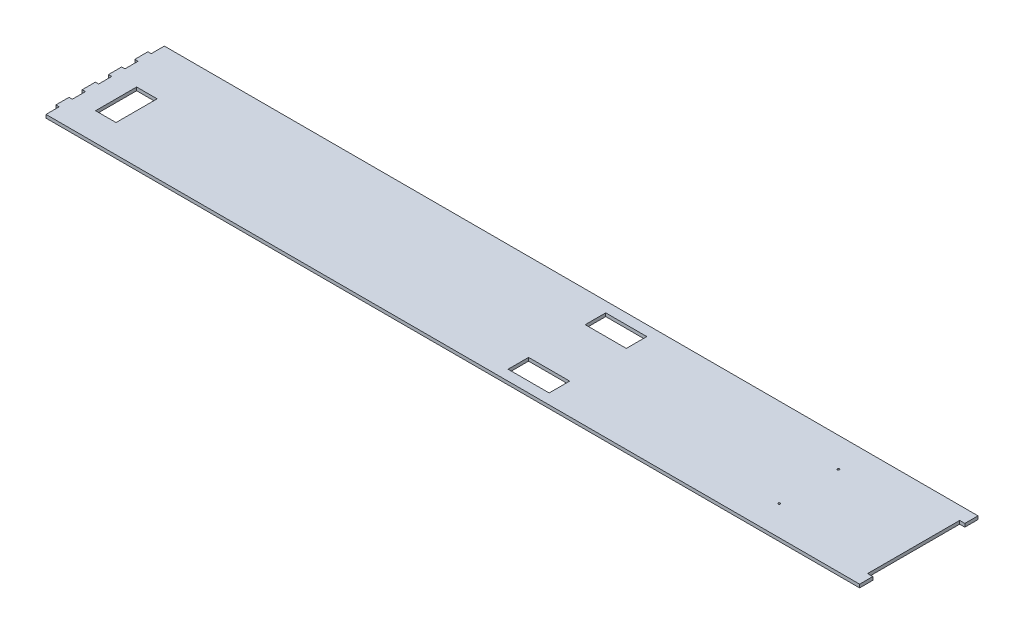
ISO-10303-21;
HEADER;
FILE_DESCRIPTION(('STEP AP214'),'2;1');
FILE_NAME('part.step','',(''),(''),'','','');
FILE_SCHEMA(('AUTOMOTIVE_DESIGN { 1 0 10303 214 1 1 1 1 }'));
ENDSEC;
DATA;
#1=APPLICATION_CONTEXT('core data for automotive mechanical design processes');
#2=APPLICATION_PROTOCOL_DEFINITION('international standard','automotive_design',2000,#1);
#3=PRODUCT_CONTEXT('',#1,'mechanical');
#4=PRODUCT('Part','Part','',(#3));
#5=PRODUCT_RELATED_PRODUCT_CATEGORY('part','',(#4));
#6=PRODUCT_DEFINITION_FORMATION('','',#4);
#7=PRODUCT_DEFINITION_CONTEXT('part definition',#1,'design');
#8=PRODUCT_DEFINITION('design','',#6,#7);
#9=PRODUCT_DEFINITION_SHAPE('','',#8);
#10=(LENGTH_UNIT() NAMED_UNIT(*) SI_UNIT(.MILLI.,.METRE.));
#11=(NAMED_UNIT(*) PLANE_ANGLE_UNIT() SI_UNIT($,.RADIAN.));
#12=(NAMED_UNIT(*) SI_UNIT($,.STERADIAN.) SOLID_ANGLE_UNIT());
#13=UNCERTAINTY_MEASURE_WITH_UNIT(LENGTH_MEASURE(1.E-05),#10,'distance_accuracy_value','');
#14=(GEOMETRIC_REPRESENTATION_CONTEXT(3) GLOBAL_UNCERTAINTY_ASSIGNED_CONTEXT((#13)) GLOBAL_UNIT_ASSIGNED_CONTEXT((#10,
#11,#12)) REPRESENTATION_CONTEXT('',''));
#15=CARTESIAN_POINT('',(0.,0.,0.));
#16=DIRECTION('',(0.,0.,1.));
#17=DIRECTION('',(1.,0.,0.));
#18=AXIS2_PLACEMENT_3D('',#15,#16,#17);
#19=CARTESIAN_POINT('',(0.,3.175,0.));
#20=DIRECTION('',(0.,1.,0.));
#21=DIRECTION('',(0.,0.,1.));
#22=AXIS2_PLACEMENT_3D('',#19,#20,#21);
#23=PLANE('',#22);
#24=DIRECTION('',(1.,0.,0.));
#25=VECTOR('',#24,1.);
#26=CARTESIAN_POINT('',(0.,3.175,47.15));
#27=LINE('',#26,#25);
#28=CARTESIAN_POINT('',(-32.1237299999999,3.175,47.15));
#29=VERTEX_POINT('',#28);
#30=CARTESIAN_POINT('',(7.56377000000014,3.175,47.15));
#31=VERTEX_POINT('',#30);
#32=EDGE_CURVE('E954',#29,#31,#27,.T.);
#33=ORIENTED_EDGE('',*,*,#32,.F.);
#34=DIRECTION('',(0.,0.,-1.));
#35=VECTOR('',#34,1.);
#36=CARTESIAN_POINT('',(-32.1237299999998,3.175,0.));
#37=LINE('',#36,#35);
#38=CARTESIAN_POINT('',(-32.1237299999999,3.175,27.3380000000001));
#39=VERTEX_POINT('',#38);
#40=EDGE_CURVE('E961',#29,#39,#37,.T.);
#41=ORIENTED_EDGE('',*,*,#40,.T.);
#42=DIRECTION('',(1.,0.,0.));
#43=VECTOR('',#42,1.);
#44=CARTESIAN_POINT('',(0.,3.175,27.3380000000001));
#45=LINE('',#44,#43);
#46=CARTESIAN_POINT('',(7.56377000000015,3.175,27.3380000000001));
#47=VERTEX_POINT('',#46);
#48=EDGE_CURVE('E958',#39,#47,#45,.T.);
#49=ORIENTED_EDGE('',*,*,#48,.T.);
#50=DIRECTION('',(0.,0.,-1.));
#51=VECTOR('',#50,1.);
#52=CARTESIAN_POINT('',(7.56377000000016,3.175,0.));
#53=LINE('',#52,#51);
#54=EDGE_CURVE('E956',#31,#47,#53,.T.);
#55=ORIENTED_EDGE('',*,*,#54,.F.);
#56=EDGE_LOOP('',(#33,#41,#49,#55));
#57=FACE_BOUND('',#56,.T.);
#58=DIRECTION('',(0.,0.,1.));
#59=VECTOR('',#58,1.);
#60=CARTESIAN_POINT('',(-32.1237299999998,3.175,0.));
#61=LINE('',#60,#59);
#62=CARTESIAN_POINT('',(-32.1237299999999,3.175,-47.15));
#63=VERTEX_POINT('',#62);
#64=CARTESIAN_POINT('',(-32.1237299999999,3.175,-27.338));
#65=VERTEX_POINT('',#64);
#66=EDGE_CURVE('E902',#63,#65,#61,.T.);
#67=ORIENTED_EDGE('',*,*,#66,.F.);
#68=DIRECTION('',(1.,0.,0.));
#69=VECTOR('',#68,1.);
#70=CARTESIAN_POINT('',(0.,3.175,-47.15));
#71=LINE('',#70,#69);
#72=CARTESIAN_POINT('',(7.56377000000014,3.175,-47.15));
#73=VERTEX_POINT('',#72);
#74=EDGE_CURVE('E951',#63,#73,#71,.T.);
#75=ORIENTED_EDGE('',*,*,#74,.T.);
#76=DIRECTION('',(0.,0.,1.));
#77=VECTOR('',#76,1.);
#78=CARTESIAN_POINT('',(7.56377000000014,3.175,0.));
#79=LINE('',#78,#77);
#80=CARTESIAN_POINT('',(7.56377000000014,3.175,-27.338));
#81=VERTEX_POINT('',#80);
#82=EDGE_CURVE('E948',#73,#81,#79,.T.);
#83=ORIENTED_EDGE('',*,*,#82,.T.);
#84=DIRECTION('',(1.,0.,0.));
#85=VECTOR('',#84,1.);
#86=CARTESIAN_POINT('',(0.,3.175,-27.338));
#87=LINE('',#86,#85);
#88=EDGE_CURVE('E946',#65,#81,#87,.T.);
#89=ORIENTED_EDGE('',*,*,#88,.F.);
#90=EDGE_LOOP('',(#67,#75,#83,#89));
#91=FACE_BOUND('',#90,.T.);
#92=CARTESIAN_POINT('',(211.101966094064,3.175,28.575));
#93=DIRECTION('',(0.,1.,0.));
#94=DIRECTION('',(0.,0.,1.));
#95=AXIS2_PLACEMENT_3D('',#92,#93,#94);
#96=CIRCLE('',#95,0.999999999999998);
#97=CARTESIAN_POINT('',(211.101966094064,3.175,29.575));
#98=VERTEX_POINT('',#97);
#99=EDGE_CURVE('E1035',#98,#98,#96,.F.);
#100=ORIENTED_EDGE('',*,*,#99,.T.);
#101=EDGE_LOOP('',(#100));
#102=FACE_BOUND('',#101,.T.);
#103=CARTESIAN_POINT('',(211.101966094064,3.175,-28.575));
#104=DIRECTION('',(0.,1.,0.));
#105=DIRECTION('',(0.,0.,1.));
#106=AXIS2_PLACEMENT_3D('',#103,#104,#105);
#107=CIRCLE('',#106,0.999999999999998);
#108=CARTESIAN_POINT('',(211.101966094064,3.175,-27.575));
#109=VERTEX_POINT('',#108);
#110=EDGE_CURVE('E1042',#109,#109,#107,.T.);
#111=ORIENTED_EDGE('',*,*,#110,.F.);
#112=EDGE_LOOP('',(#111));
#113=FACE_BOUND('',#112,.T.);
#114=DIRECTION('',(0.,0.,1.));
#115=VECTOR('',#114,1.);
#116=CARTESIAN_POINT('',(317.36377,3.175,0.));
#117=LINE('',#116,#115);
#118=CARTESIAN_POINT('',(317.36377,3.175,-57.15));
#119=VERTEX_POINT('',#118);
#120=CARTESIAN_POINT('',(317.36377,3.175,-44.45));
#121=VERTEX_POINT('',#120);
#122=EDGE_CURVE('E1017',#119,#121,#117,.T.);
#123=ORIENTED_EDGE('',*,*,#122,.F.);
#124=DIRECTION('',(1.,0.,0.));
#125=VECTOR('',#124,1.);
#126=CARTESIAN_POINT('',(0.,3.175,-57.15));
#127=LINE('',#126,#125);
#128=CARTESIAN_POINT('',(-468.3125,3.175,-57.15));
#129=VERTEX_POINT('',#128);
#130=EDGE_CURVE('E1057',#129,#119,#127,.T.);
#131=ORIENTED_EDGE('',*,*,#130,.F.);
#132=DIRECTION('',(0.,0.,-1.));
#133=VECTOR('',#132,1.);
#134=CARTESIAN_POINT('',(-468.3125,3.175,0.));
#135=LINE('',#134,#133);
#136=CARTESIAN_POINT('',(-468.3125,3.175,-44.45));
#137=VERTEX_POINT('',#136);
#138=EDGE_CURVE('E1054',#137,#129,#135,.T.);
#139=ORIENTED_EDGE('',*,*,#138,.F.);
#140=DIRECTION('',(1.,0.,0.));
#141=VECTOR('',#140,1.);
#142=CARTESIAN_POINT('',(0.,3.175,-44.450000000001));
#143=LINE('',#142,#141);
#144=CARTESIAN_POINT('',(-471.4875,3.175,-44.45));
#145=VERTEX_POINT('',#144);
#146=EDGE_CURVE('E1060',#145,#137,#143,.T.);
#147=ORIENTED_EDGE('',*,*,#146,.F.);
#148=DIRECTION('',(0.,0.,1.));
#149=VECTOR('',#148,1.);
#150=CARTESIAN_POINT('',(-471.4875,3.175,-2.28983498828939E-13));
#151=LINE('',#150,#149);
#152=CARTESIAN_POINT('',(-471.4875,3.175,-31.75));
#153=VERTEX_POINT('',#152);
#154=EDGE_CURVE('E1064',#145,#153,#151,.T.);
#155=ORIENTED_EDGE('',*,*,#154,.T.);
#156=DIRECTION('',(-1.,0.,0.));
#157=VECTOR('',#156,1.);
#158=CARTESIAN_POINT('',(0.,3.175,-31.750000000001));
#159=LINE('',#158,#157);
#160=CARTESIAN_POINT('',(-468.3125,3.175,-31.75));
#161=VERTEX_POINT('',#160);
#162=EDGE_CURVE('E1067',#161,#153,#159,.T.);
#163=ORIENTED_EDGE('',*,*,#162,.F.);
#164=CARTESIAN_POINT('',(-468.3125,3.175,-19.05));
#165=VERTEX_POINT('',#164);
#166=EDGE_CURVE('E1071',#165,#161,#135,.T.);
#167=ORIENTED_EDGE('',*,*,#166,.F.);
#168=DIRECTION('',(-1.,0.,0.));
#169=VECTOR('',#168,1.);
#170=CARTESIAN_POINT('',(0.,3.175,-19.050000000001));
#171=LINE('',#170,#169);
#172=CARTESIAN_POINT('',(-471.4875,3.175,-19.05));
#173=VERTEX_POINT('',#172);
#174=EDGE_CURVE('E1072',#165,#173,#171,.T.);
#175=ORIENTED_EDGE('',*,*,#174,.T.);
#176=DIRECTION('',(0.,0.,1.));
#177=VECTOR('',#176,1.);
#178=CARTESIAN_POINT('',(-471.4875,3.175,-2.28983498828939E-13));
#179=LINE('',#178,#177);
#180=CARTESIAN_POINT('',(-471.4875,3.175,-6.35000000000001));
#181=VERTEX_POINT('',#180);
#182=EDGE_CURVE('E1075',#173,#181,#179,.T.);
#183=ORIENTED_EDGE('',*,*,#182,.T.);
#184=DIRECTION('',(-1.,0.,0.));
#185=VECTOR('',#184,1.);
#186=CARTESIAN_POINT('',(0.,3.175,-6.35000000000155));
#187=LINE('',#186,#185);
#188=CARTESIAN_POINT('',(-468.3125,3.175,-6.35000000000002));
#189=VERTEX_POINT('',#188);
#190=EDGE_CURVE('E1078',#189,#181,#187,.T.);
#191=ORIENTED_EDGE('',*,*,#190,.F.);
#192=CARTESIAN_POINT('',(-468.3125,3.175,6.34999999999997));
#193=VERTEX_POINT('',#192);
#194=EDGE_CURVE('E1082',#193,#189,#135,.T.);
#195=ORIENTED_EDGE('',*,*,#194,.F.);
#196=DIRECTION('',(-1.,0.,0.));
#197=VECTOR('',#196,1.);
#198=CARTESIAN_POINT('',(0.,3.175,6.34999999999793));
#199=LINE('',#198,#197);
#200=CARTESIAN_POINT('',(-471.4875,3.175,6.34999999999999));
#201=VERTEX_POINT('',#200);
#202=EDGE_CURVE('E1083',#193,#201,#199,.T.);
#203=ORIENTED_EDGE('',*,*,#202,.T.);
#204=DIRECTION('',(0.,0.,1.));
#205=VECTOR('',#204,1.);
#206=CARTESIAN_POINT('',(-471.4875,3.175,-2.28983498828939E-13));
#207=LINE('',#206,#205);
#208=CARTESIAN_POINT('',(-471.4875,3.175,19.05));
#209=VERTEX_POINT('',#208);
#210=EDGE_CURVE('E1086',#201,#209,#207,.T.);
#211=ORIENTED_EDGE('',*,*,#210,.T.);
#212=DIRECTION('',(-1.,0.,0.));
#213=VECTOR('',#212,1.);
#214=CARTESIAN_POINT('',(0.,3.175,19.0499999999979));
#215=LINE('',#214,#213);
#216=CARTESIAN_POINT('',(-468.3125,3.175,19.05));
#217=VERTEX_POINT('',#216);
#218=EDGE_CURVE('E1089',#217,#209,#215,.T.);
#219=ORIENTED_EDGE('',*,*,#218,.F.);
#220=CARTESIAN_POINT('',(-468.3125,3.175,31.75));
#221=VERTEX_POINT('',#220);
#222=EDGE_CURVE('E1053',#221,#217,#135,.T.);
#223=ORIENTED_EDGE('',*,*,#222,.F.);
#224=DIRECTION('',(-1.,0.,0.));
#225=VECTOR('',#224,1.);
#226=CARTESIAN_POINT('',(0.,3.175,31.7499999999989));
#227=LINE('',#226,#225);
#228=CARTESIAN_POINT('',(-471.4875,3.175,31.75));
#229=VERTEX_POINT('',#228);
#230=EDGE_CURVE('E1093',#221,#229,#227,.T.);
#231=ORIENTED_EDGE('',*,*,#230,.T.);
#232=DIRECTION('',(0.,0.,1.));
#233=VECTOR('',#232,1.);
#234=CARTESIAN_POINT('',(-471.4875,3.175,-2.28983498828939E-13));
#235=LINE('',#234,#233);
#236=CARTESIAN_POINT('',(-471.4875,3.175,44.45));
#237=VERTEX_POINT('',#236);
#238=EDGE_CURVE('E1096',#229,#237,#235,.T.);
#239=ORIENTED_EDGE('',*,*,#238,.T.);
#240=DIRECTION('',(-1.,0.,0.));
#241=VECTOR('',#240,1.);
#242=CARTESIAN_POINT('',(2.9143354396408E-13,3.175,44.4499999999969));
#243=LINE('',#242,#241);
#244=CARTESIAN_POINT('',(-468.3125,3.175,44.45));
#245=VERTEX_POINT('',#244);
#246=EDGE_CURVE('E1099',#245,#237,#243,.T.);
#247=ORIENTED_EDGE('',*,*,#246,.F.);
#248=CARTESIAN_POINT('',(-468.312499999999,3.175,57.15));
#249=VERTEX_POINT('',#248);
#250=EDGE_CURVE('E1047',#249,#245,#135,.T.);
#251=ORIENTED_EDGE('',*,*,#250,.F.);
#252=DIRECTION('',(1.,0.,0.));
#253=VECTOR('',#252,1.);
#254=CARTESIAN_POINT('',(0.,3.175,57.15));
#255=LINE('',#254,#253);
#256=CARTESIAN_POINT('',(317.36377,3.175,57.15));
#257=VERTEX_POINT('',#256);
#258=EDGE_CURVE('E1051',#249,#257,#255,.T.);
#259=ORIENTED_EDGE('',*,*,#258,.T.);
#260=DIRECTION('',(0.,0.,-1.));
#261=VECTOR('',#260,1.);
#262=CARTESIAN_POINT('',(317.36377,3.175,0.));
#263=LINE('',#262,#261);
#264=CARTESIAN_POINT('',(317.36377,3.175,44.45));
#265=VERTEX_POINT('',#264);
#266=EDGE_CURVE('E994',#257,#265,#263,.T.);
#267=ORIENTED_EDGE('',*,*,#266,.T.);
#268=DIRECTION('',(-1.,0.,0.));
#269=VECTOR('',#268,1.);
#270=CARTESIAN_POINT('',(0.,3.175,44.45));
#271=LINE('',#270,#269);
#272=CARTESIAN_POINT('',(312.36377,3.175,44.45));
#273=VERTEX_POINT('',#272);
#274=EDGE_CURVE('E1020',#265,#273,#271,.T.);
#275=ORIENTED_EDGE('',*,*,#274,.T.);
#276=DIRECTION('',(0.,0.,1.));
#277=VECTOR('',#276,1.);
#278=CARTESIAN_POINT('',(312.36377,3.175,0.));
#279=LINE('',#278,#277);
#280=CARTESIAN_POINT('',(312.36377,3.175,-44.45));
#281=VERTEX_POINT('',#280);
#282=EDGE_CURVE('E1027',#281,#273,#279,.T.);
#283=ORIENTED_EDGE('',*,*,#282,.F.);
#284=DIRECTION('',(-1.,0.,0.));
#285=VECTOR('',#284,1.);
#286=CARTESIAN_POINT('',(0.,3.175,-44.45));
#287=LINE('',#286,#285);
#288=EDGE_CURVE('E1024',#121,#281,#287,.T.);
#289=ORIENTED_EDGE('',*,*,#288,.F.);
#290=EDGE_LOOP('',(#123,#131,#139,#147,#155,#163,#167,#175,#183,#191,#195,#203,#211,#219,#223,
#231,#239,#247,#251,#259,#267,#275,#283,#289));
#291=FACE_BOUND('',#290,.T.);
#292=DIRECTION('',(-1.,0.,0.));
#293=VECTOR('',#292,1.);
#294=CARTESIAN_POINT('',(0.,3.175,30.1624999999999));
#295=LINE('',#294,#293);
#296=CARTESIAN_POINT('',(-427.682733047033,3.175,30.1625));
#297=VERTEX_POINT('',#296);
#298=CARTESIAN_POINT('',(-447.494733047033,3.175,30.1625));
#299=VERTEX_POINT('',#298);
#300=EDGE_CURVE('E964',#297,#299,#295,.T.);
#301=ORIENTED_EDGE('',*,*,#300,.T.);
#302=DIRECTION('',(0.,0.,-1.));
#303=VECTOR('',#302,1.);
#304=CARTESIAN_POINT('',(-447.494733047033,3.175,0.));
#305=LINE('',#304,#303);
#306=CARTESIAN_POINT('',(-447.494733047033,3.175,-9.525));
#307=VERTEX_POINT('',#306);
#308=EDGE_CURVE('E886',#299,#307,#305,.T.);
#309=ORIENTED_EDGE('',*,*,#308,.T.);
#310=DIRECTION('',(-1.,0.,0.));
#311=VECTOR('',#310,1.);
#312=CARTESIAN_POINT('',(0.,3.175,-9.52500000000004));
#313=LINE('',#312,#311);
#314=CARTESIAN_POINT('',(-427.682733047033,3.175,-9.525));
#315=VERTEX_POINT('',#314);
#316=EDGE_CURVE('E968',#315,#307,#313,.T.);
#317=ORIENTED_EDGE('',*,*,#316,.F.);
#318=DIRECTION('',(0.,0.,-1.));
#319=VECTOR('',#318,1.);
#320=CARTESIAN_POINT('',(-427.682733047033,3.175,0.));
#321=LINE('',#320,#319);
#322=EDGE_CURVE('E966',#297,#315,#321,.T.);
#323=ORIENTED_EDGE('',*,*,#322,.F.);
#324=EDGE_LOOP('',(#301,#309,#317,#323));
#325=FACE_BOUND('',#324,.T.);
#326=ADVANCED_FACE('F639',(#57,#91,#102,#113,#291,#325),#23,.T.);
#327=CARTESIAN_POINT('',(0.,0.,0.));
#328=DIRECTION('',(0.,1.,0.));
#329=DIRECTION('',(0.,0.,1.));
#330=AXIS2_PLACEMENT_3D('',#327,#328,#329);
#331=PLANE('',#330);
#332=DIRECTION('',(0.,0.,-1.));
#333=VECTOR('',#332,1.);
#334=CARTESIAN_POINT('',(-32.1237299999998,0.,0.));
#335=LINE('',#334,#333);
#336=CARTESIAN_POINT('',(-32.1237299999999,0.,47.15));
#337=VERTEX_POINT('',#336);
#338=CARTESIAN_POINT('',(-32.1237299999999,0.,27.3380000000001));
#339=VERTEX_POINT('',#338);
#340=EDGE_CURVE('E893',#337,#339,#335,.T.);
#341=ORIENTED_EDGE('',*,*,#340,.F.);
#342=DIRECTION('',(1.,0.,0.));
#343=VECTOR('',#342,1.);
#344=CARTESIAN_POINT('',(0.,0.,47.15));
#345=LINE('',#344,#343);
#346=CARTESIAN_POINT('',(7.56377000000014,0.,47.15));
#347=VERTEX_POINT('',#346);
#348=EDGE_CURVE('E895',#337,#347,#345,.T.);
#349=ORIENTED_EDGE('',*,*,#348,.T.);
#350=DIRECTION('',(0.,0.,-1.));
#351=VECTOR('',#350,1.);
#352=CARTESIAN_POINT('',(7.56377000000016,0.,0.));
#353=LINE('',#352,#351);
#354=CARTESIAN_POINT('',(7.56377000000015,0.,27.3380000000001));
#355=VERTEX_POINT('',#354);
#356=EDGE_CURVE('E920',#347,#355,#353,.T.);
#357=ORIENTED_EDGE('',*,*,#356,.T.);
#358=DIRECTION('',(1.,0.,0.));
#359=VECTOR('',#358,1.);
#360=CARTESIAN_POINT('',(0.,0.,27.3380000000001));
#361=LINE('',#360,#359);
#362=EDGE_CURVE('E908',#339,#355,#361,.T.);
#363=ORIENTED_EDGE('',*,*,#362,.F.);
#364=EDGE_LOOP('',(#341,#349,#357,#363));
#365=FACE_BOUND('',#364,.T.);
#366=CARTESIAN_POINT('',(211.101966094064,0.,28.575));
#367=DIRECTION('',(0.,1.,0.));
#368=DIRECTION('',(0.,0.,1.));
#369=AXIS2_PLACEMENT_3D('',#366,#367,#368);
#370=CIRCLE('',#369,0.999999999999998);
#371=CARTESIAN_POINT('',(211.101966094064,0.,29.575));
#372=VERTEX_POINT('',#371);
#373=EDGE_CURVE('E1030',#372,#372,#370,.F.);
#374=ORIENTED_EDGE('',*,*,#373,.F.);
#375=EDGE_LOOP('',(#374));
#376=FACE_BOUND('',#375,.T.);
#377=CARTESIAN_POINT('',(211.101966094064,0.,-28.575));
#378=DIRECTION('',(0.,1.,0.));
#379=DIRECTION('',(0.,0.,1.));
#380=AXIS2_PLACEMENT_3D('',#377,#378,#379);
#381=CIRCLE('',#380,0.999999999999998);
#382=CARTESIAN_POINT('',(211.101966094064,0.,-27.575));
#383=VERTEX_POINT('',#382);
#384=EDGE_CURVE('E1031',#383,#383,#381,.T.);
#385=ORIENTED_EDGE('',*,*,#384,.T.);
#386=EDGE_LOOP('',(#385));
#387=FACE_BOUND('',#386,.T.);
#388=DIRECTION('',(1.,0.,0.));
#389=VECTOR('',#388,1.);
#390=CARTESIAN_POINT('',(0.,0.,-57.15));
#391=LINE('',#390,#389);
#392=CARTESIAN_POINT('',(-468.3125,0.,-57.15));
#393=VERTEX_POINT('',#392);
#394=CARTESIAN_POINT('',(317.36377,0.,-57.15));
#395=VERTEX_POINT('',#394);
#396=EDGE_CURVE('E1112',#393,#395,#391,.T.);
#397=ORIENTED_EDGE('',*,*,#396,.T.);
#398=DIRECTION('',(0.,0.,1.));
#399=VECTOR('',#398,1.);
#400=CARTESIAN_POINT('',(317.36377,0.,0.));
#401=LINE('',#400,#399);
#402=CARTESIAN_POINT('',(317.36377,0.,-44.45));
#403=VERTEX_POINT('',#402);
#404=EDGE_CURVE('E981',#395,#403,#401,.T.);
#405=ORIENTED_EDGE('',*,*,#404,.T.);
#406=DIRECTION('',(-1.,0.,0.));
#407=VECTOR('',#406,1.);
#408=CARTESIAN_POINT('',(0.,0.,-44.45));
#409=LINE('',#408,#407);
#410=CARTESIAN_POINT('',(312.36377,0.,-44.45));
#411=VERTEX_POINT('',#410);
#412=EDGE_CURVE('E985',#403,#411,#409,.T.);
#413=ORIENTED_EDGE('',*,*,#412,.T.);
#414=DIRECTION('',(0.,0.,1.));
#415=VECTOR('',#414,1.);
#416=CARTESIAN_POINT('',(312.36377,0.,0.));
#417=LINE('',#416,#415);
#418=CARTESIAN_POINT('',(312.36377,0.,44.45));
#419=VERTEX_POINT('',#418);
#420=EDGE_CURVE('E971',#411,#419,#417,.T.);
#421=ORIENTED_EDGE('',*,*,#420,.T.);
#422=DIRECTION('',(-1.,0.,0.));
#423=VECTOR('',#422,1.);
#424=CARTESIAN_POINT('',(0.,0.,44.45));
#425=LINE('',#424,#423);
#426=CARTESIAN_POINT('',(317.36377,0.,44.45));
#427=VERTEX_POINT('',#426);
#428=EDGE_CURVE('E975',#427,#419,#425,.T.);
#429=ORIENTED_EDGE('',*,*,#428,.F.);
#430=DIRECTION('',(0.,0.,-1.));
#431=VECTOR('',#430,1.);
#432=CARTESIAN_POINT('',(317.36377,0.,0.));
#433=LINE('',#432,#431);
#434=CARTESIAN_POINT('',(317.36377,0.,57.15));
#435=VERTEX_POINT('',#434);
#436=EDGE_CURVE('E978',#435,#427,#433,.T.);
#437=ORIENTED_EDGE('',*,*,#436,.F.);
#438=DIRECTION('',(1.,0.,0.));
#439=VECTOR('',#438,1.);
#440=CARTESIAN_POINT('',(0.,0.,57.15));
#441=LINE('',#440,#439);
#442=CARTESIAN_POINT('',(-468.312499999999,0.,57.15));
#443=VERTEX_POINT('',#442);
#444=EDGE_CURVE('E1107',#443,#435,#441,.T.);
#445=ORIENTED_EDGE('',*,*,#444,.F.);
#446=DIRECTION('',(0.,0.,-1.));
#447=VECTOR('',#446,1.);
#448=CARTESIAN_POINT('',(-468.3125,0.,0.));
#449=LINE('',#448,#447);
#450=CARTESIAN_POINT('',(-468.3125,0.,44.45));
#451=VERTEX_POINT('',#450);
#452=EDGE_CURVE('E1046',#443,#451,#449,.T.);
#453=ORIENTED_EDGE('',*,*,#452,.T.);
#454=DIRECTION('',(-1.,0.,0.));
#455=VECTOR('',#454,1.);
#456=CARTESIAN_POINT('',(2.9143354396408E-13,0.,44.4499999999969));
#457=LINE('',#456,#455);
#458=CARTESIAN_POINT('',(-471.4875,0.,44.45));
#459=VERTEX_POINT('',#458);
#460=EDGE_CURVE('E1052',#451,#459,#457,.T.);
#461=ORIENTED_EDGE('',*,*,#460,.T.);
#462=DIRECTION('',(0.,0.,1.));
#463=VECTOR('',#462,1.);
#464=CARTESIAN_POINT('',(-471.4875,0.,-2.28983498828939E-13));
#465=LINE('',#464,#463);
#466=CARTESIAN_POINT('',(-471.4875,0.,31.75));
#467=VERTEX_POINT('',#466);
#468=EDGE_CURVE('E1154',#467,#459,#465,.T.);
#469=ORIENTED_EDGE('',*,*,#468,.F.);
#470=DIRECTION('',(-1.,0.,0.));
#471=VECTOR('',#470,1.);
#472=CARTESIAN_POINT('',(0.,0.,31.7499999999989));
#473=LINE('',#472,#471);
#474=CARTESIAN_POINT('',(-468.3125,0.,31.75));
#475=VERTEX_POINT('',#474);
#476=EDGE_CURVE('E1151',#475,#467,#473,.T.);
#477=ORIENTED_EDGE('',*,*,#476,.F.);
#478=CARTESIAN_POINT('',(-468.3125,0.,19.05));
#479=VERTEX_POINT('',#478);
#480=EDGE_CURVE('E1108',#475,#479,#449,.T.);
#481=ORIENTED_EDGE('',*,*,#480,.T.);
#482=DIRECTION('',(-1.,0.,0.));
#483=VECTOR('',#482,1.);
#484=CARTESIAN_POINT('',(0.,0.,19.0499999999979));
#485=LINE('',#484,#483);
#486=CARTESIAN_POINT('',(-471.4875,0.,19.05));
#487=VERTEX_POINT('',#486);
#488=EDGE_CURVE('E1147',#479,#487,#485,.T.);
#489=ORIENTED_EDGE('',*,*,#488,.T.);
#490=DIRECTION('',(0.,0.,1.));
#491=VECTOR('',#490,1.);
#492=CARTESIAN_POINT('',(-471.4875,0.,-2.28983498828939E-13));
#493=LINE('',#492,#491);
#494=CARTESIAN_POINT('',(-471.4875,0.,6.34999999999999));
#495=VERTEX_POINT('',#494);
#496=EDGE_CURVE('E1143',#495,#487,#493,.T.);
#497=ORIENTED_EDGE('',*,*,#496,.F.);
#498=DIRECTION('',(-1.,0.,0.));
#499=VECTOR('',#498,1.);
#500=CARTESIAN_POINT('',(0.,0.,6.34999999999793));
#501=LINE('',#500,#499);
#502=CARTESIAN_POINT('',(-468.3125,0.,6.34999999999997));
#503=VERTEX_POINT('',#502);
#504=EDGE_CURVE('E1140',#503,#495,#501,.T.);
#505=ORIENTED_EDGE('',*,*,#504,.F.);
#506=CARTESIAN_POINT('',(-468.3125,0.,-6.35000000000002));
#507=VERTEX_POINT('',#506);
#508=EDGE_CURVE('E1139',#503,#507,#449,.T.);
#509=ORIENTED_EDGE('',*,*,#508,.T.);
#510=DIRECTION('',(-1.,0.,0.));
#511=VECTOR('',#510,1.);
#512=CARTESIAN_POINT('',(0.,0.,-6.35000000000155));
#513=LINE('',#512,#511);
#514=CARTESIAN_POINT('',(-471.4875,0.,-6.35000000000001));
#515=VERTEX_POINT('',#514);
#516=EDGE_CURVE('E1135',#507,#515,#513,.T.);
#517=ORIENTED_EDGE('',*,*,#516,.T.);
#518=DIRECTION('',(0.,0.,1.));
#519=VECTOR('',#518,1.);
#520=CARTESIAN_POINT('',(-471.4875,0.,-2.28983498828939E-13));
#521=LINE('',#520,#519);
#522=CARTESIAN_POINT('',(-471.4875,0.,-19.05));
#523=VERTEX_POINT('',#522);
#524=EDGE_CURVE('E1131',#523,#515,#521,.T.);
#525=ORIENTED_EDGE('',*,*,#524,.F.);
#526=DIRECTION('',(-1.,0.,0.));
#527=VECTOR('',#526,1.);
#528=CARTESIAN_POINT('',(0.,0.,-19.050000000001));
#529=LINE('',#528,#527);
#530=CARTESIAN_POINT('',(-468.3125,0.,-19.05));
#531=VERTEX_POINT('',#530);
#532=EDGE_CURVE('E1128',#531,#523,#529,.T.);
#533=ORIENTED_EDGE('',*,*,#532,.F.);
#534=CARTESIAN_POINT('',(-468.3125,0.,-31.75));
#535=VERTEX_POINT('',#534);
#536=EDGE_CURVE('E1127',#531,#535,#449,.T.);
#537=ORIENTED_EDGE('',*,*,#536,.T.);
#538=DIRECTION('',(-1.,0.,0.));
#539=VECTOR('',#538,1.);
#540=CARTESIAN_POINT('',(0.,0.,-31.750000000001));
#541=LINE('',#540,#539);
#542=CARTESIAN_POINT('',(-471.4875,0.,-31.75));
#543=VERTEX_POINT('',#542);
#544=EDGE_CURVE('E1123',#535,#543,#541,.T.);
#545=ORIENTED_EDGE('',*,*,#544,.T.);
#546=DIRECTION('',(0.,0.,1.));
#547=VECTOR('',#546,1.);
#548=CARTESIAN_POINT('',(-471.4875,0.,-2.28983498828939E-13));
#549=LINE('',#548,#547);
#550=CARTESIAN_POINT('',(-471.4875,0.,-44.45));
#551=VERTEX_POINT('',#550);
#552=EDGE_CURVE('E1119',#551,#543,#549,.T.);
#553=ORIENTED_EDGE('',*,*,#552,.F.);
#554=DIRECTION('',(1.,0.,0.));
#555=VECTOR('',#554,1.);
#556=CARTESIAN_POINT('',(0.,0.,-44.450000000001));
#557=LINE('',#556,#555);
#558=CARTESIAN_POINT('',(-468.3125,0.,-44.45));
#559=VERTEX_POINT('',#558);
#560=EDGE_CURVE('E1115',#551,#559,#557,.T.);
#561=ORIENTED_EDGE('',*,*,#560,.T.);
#562=EDGE_CURVE('E1109',#559,#393,#449,.T.);
#563=ORIENTED_EDGE('',*,*,#562,.T.);
#564=EDGE_LOOP('',(#397,#405,#413,#421,#429,#437,#445,#453,#461,#469,#477,#481,#489,#497,#505,
#509,#517,#525,#533,#537,#545,#553,#561,#563));
#565=FACE_BOUND('',#564,.T.);
#566=DIRECTION('',(1.,0.,0.));
#567=VECTOR('',#566,1.);
#568=CARTESIAN_POINT('',(-32.1237299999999,0.,-47.15));
#569=LINE('',#568,#567);
#570=CARTESIAN_POINT('',(-32.1237299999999,0.,-47.15));
#571=VERTEX_POINT('',#570);
#572=CARTESIAN_POINT('',(7.56377000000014,0.,-47.15));
#573=VERTEX_POINT('',#572);
#574=EDGE_CURVE('E918',#571,#573,#569,.T.);
#575=ORIENTED_EDGE('',*,*,#574,.F.);
#576=DIRECTION('',(0.,0.,1.));
#577=VECTOR('',#576,1.);
#578=CARTESIAN_POINT('',(-32.1237299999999,0.,-47.15));
#579=LINE('',#578,#577);
#580=CARTESIAN_POINT('',(-32.1237299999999,0.,-27.338));
#581=VERTEX_POINT('',#580);
#582=EDGE_CURVE('E936',#571,#581,#579,.T.);
#583=ORIENTED_EDGE('',*,*,#582,.T.);
#584=DIRECTION('',(1.,0.,0.));
#585=VECTOR('',#584,1.);
#586=CARTESIAN_POINT('',(-32.1237299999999,0.,-27.338));
#587=LINE('',#586,#585);
#588=CARTESIAN_POINT('',(7.56377000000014,0.,-27.338));
#589=VERTEX_POINT('',#588);
#590=EDGE_CURVE('E939',#581,#589,#587,.T.);
#591=ORIENTED_EDGE('',*,*,#590,.T.);
#592=DIRECTION('',(0.,0.,1.));
#593=VECTOR('',#592,1.);
#594=CARTESIAN_POINT('',(7.56377000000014,0.,-47.15));
#595=LINE('',#594,#593);
#596=EDGE_CURVE('E942',#573,#589,#595,.T.);
#597=ORIENTED_EDGE('',*,*,#596,.F.);
#598=EDGE_LOOP('',(#575,#583,#591,#597));
#599=FACE_BOUND('',#598,.T.);
#600=DIRECTION('',(0.,0.,-1.));
#601=VECTOR('',#600,1.);
#602=CARTESIAN_POINT('',(-447.494733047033,0.,0.));
#603=LINE('',#602,#601);
#604=CARTESIAN_POINT('',(-447.494733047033,0.,30.1625));
#605=VERTEX_POINT('',#604);
#606=CARTESIAN_POINT('',(-447.494733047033,0.,-9.525));
#607=VERTEX_POINT('',#606);
#608=EDGE_CURVE('E879',#605,#607,#603,.T.);
#609=ORIENTED_EDGE('',*,*,#608,.F.);
#610=DIRECTION('',(-1.,0.,0.));
#611=VECTOR('',#610,1.);
#612=CARTESIAN_POINT('',(0.,0.,30.1624999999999));
#613=LINE('',#612,#611);
#614=CARTESIAN_POINT('',(-427.682733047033,0.,30.1625));
#615=VERTEX_POINT('',#614);
#616=EDGE_CURVE('E871',#615,#605,#613,.T.);
#617=ORIENTED_EDGE('',*,*,#616,.F.);
#618=DIRECTION('',(0.,0.,-1.));
#619=VECTOR('',#618,1.);
#620=CARTESIAN_POINT('',(-427.682733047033,0.,0.));
#621=LINE('',#620,#619);
#622=CARTESIAN_POINT('',(-427.682733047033,0.,-9.525));
#623=VERTEX_POINT('',#622);
#624=EDGE_CURVE('E878',#615,#623,#621,.T.);
#625=ORIENTED_EDGE('',*,*,#624,.T.);
#626=DIRECTION('',(-1.,0.,0.));
#627=VECTOR('',#626,1.);
#628=CARTESIAN_POINT('',(0.,0.,-9.52500000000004));
#629=LINE('',#628,#627);
#630=EDGE_CURVE('E888',#623,#607,#629,.T.);
#631=ORIENTED_EDGE('',*,*,#630,.T.);
#632=EDGE_LOOP('',(#609,#617,#625,#631));
#633=FACE_BOUND('',#632,.T.);
#634=ADVANCED_FACE('F891',(#365,#376,#387,#565,#599,#633),#331,.F.);
#635=CARTESIAN_POINT('',(0.,3.175,57.15));
#636=DIRECTION('',(0.,0.,-1.));
#637=DIRECTION('',(-1.,0.,0.));
#638=AXIS2_PLACEMENT_3D('',#635,#636,#637);
#639=PLANE('',#638);
#640=ORIENTED_EDGE('',*,*,#444,.T.);
#641=DIRECTION('',(0.,1.,0.));
#642=VECTOR('',#641,1.);
#643=CARTESIAN_POINT('',(317.36377,0.,57.15));
#644=LINE('',#643,#642);
#645=EDGE_CURVE('E1003',#435,#257,#644,.T.);
#646=ORIENTED_EDGE('',*,*,#645,.T.);
#647=ORIENTED_EDGE('',*,*,#258,.F.);
#648=DIRECTION('',(0.,-1.,0.));
#649=VECTOR('',#648,1.);
#650=CARTESIAN_POINT('',(-468.312499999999,3.175,57.15));
#651=LINE('',#650,#649);
#652=EDGE_CURVE('E12',#249,#443,#651,.T.);
#653=ORIENTED_EDGE('',*,*,#652,.T.);
#654=EDGE_LOOP('',(#640,#646,#647,#653));
#655=FACE_BOUND('',#654,.T.);
#656=ADVANCED_FACE('F641',(#655),#639,.F.);
#657=CARTESIAN_POINT('',(0.,3.175,-57.15));
#658=DIRECTION('',(0.,0.,-1.));
#659=DIRECTION('',(-1.,0.,0.));
#660=AXIS2_PLACEMENT_3D('',#657,#658,#659);
#661=PLANE('',#660);
#662=ORIENTED_EDGE('',*,*,#130,.T.);
#663=DIRECTION('',(0.,1.,0.));
#664=VECTOR('',#663,1.);
#665=CARTESIAN_POINT('',(317.36377,0.,-57.15));
#666=LINE('',#665,#664);
#667=EDGE_CURVE('E999',#395,#119,#666,.T.);
#668=ORIENTED_EDGE('',*,*,#667,.F.);
#669=ORIENTED_EDGE('',*,*,#396,.F.);
#670=DIRECTION('',(0.,-1.,0.));
#671=VECTOR('',#670,1.);
#672=CARTESIAN_POINT('',(-468.3125,3.175,-57.15));
#673=LINE('',#672,#671);
#674=EDGE_CURVE('E648',#129,#393,#673,.T.);
#675=ORIENTED_EDGE('',*,*,#674,.F.);
#676=EDGE_LOOP('',(#662,#668,#669,#675));
#677=FACE_BOUND('',#676,.T.);
#678=ADVANCED_FACE('F1222',(#677),#661,.T.);
#679=CARTESIAN_POINT('',(-468.3125,3.175,0.));
#680=DIRECTION('',(-1.,0.,0.));
#681=DIRECTION('',(0.,0.,1.));
#682=AXIS2_PLACEMENT_3D('',#679,#680,#681);
#683=PLANE('',#682);
#684=ORIENTED_EDGE('',*,*,#452,.F.);
#685=ORIENTED_EDGE('',*,*,#652,.F.);
#686=ORIENTED_EDGE('',*,*,#250,.T.);
#687=DIRECTION('',(0.,-1.,0.));
#688=VECTOR('',#687,1.);
#689=CARTESIAN_POINT('',(-468.3125,3.175,44.45));
#690=LINE('',#689,#688);
#691=EDGE_CURVE('E1103',#245,#451,#690,.T.);
#692=ORIENTED_EDGE('',*,*,#691,.T.);
#693=EDGE_LOOP('',(#684,#685,#686,#692));
#694=FACE_BOUND('',#693,.T.);
#695=ADVANCED_FACE('F1366',(#694),#683,.T.);
#696=ORIENTED_EDGE('',*,*,#562,.F.);
#697=DIRECTION('',(0.,-1.,0.));
#698=VECTOR('',#697,1.);
#699=CARTESIAN_POINT('',(-468.3125,3.175,-44.45));
#700=LINE('',#699,#698);
#701=EDGE_CURVE('E1208',#137,#559,#700,.T.);
#702=ORIENTED_EDGE('',*,*,#701,.F.);
#703=ORIENTED_EDGE('',*,*,#138,.T.);
#704=ORIENTED_EDGE('',*,*,#674,.T.);
#705=EDGE_LOOP('',(#696,#702,#703,#704));
#706=FACE_BOUND('',#705,.T.);
#707=ADVANCED_FACE('F1216',(#706),#683,.T.);
#708=CARTESIAN_POINT('',(0.,3.175,-44.450000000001));
#709=DIRECTION('',(0.,0.,-1.));
#710=DIRECTION('',(-1.,0.,0.));
#711=AXIS2_PLACEMENT_3D('',#708,#709,#710);
#712=PLANE('',#711);
#713=ORIENTED_EDGE('',*,*,#560,.F.);
#714=DIRECTION('',(0.,-1.,0.));
#715=VECTOR('',#714,1.);
#716=CARTESIAN_POINT('',(-471.4875,3.175,-44.45));
#717=LINE('',#716,#715);
#718=EDGE_CURVE('E1205',#145,#551,#717,.T.);
#719=ORIENTED_EDGE('',*,*,#718,.F.);
#720=ORIENTED_EDGE('',*,*,#146,.T.);
#721=ORIENTED_EDGE('',*,*,#701,.T.);
#722=EDGE_LOOP('',(#713,#719,#720,#721));
#723=FACE_BOUND('',#722,.T.);
#724=ADVANCED_FACE('F1291',(#723),#712,.T.);
#725=CARTESIAN_POINT('',(-471.4875,3.175,-2.28983498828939E-13));
#726=DIRECTION('',(1.,0.,0.));
#727=DIRECTION('',(0.,0.,-1.));
#728=AXIS2_PLACEMENT_3D('',#725,#726,#727);
#729=PLANE('',#728);
#730=ORIENTED_EDGE('',*,*,#552,.T.);
#731=DIRECTION('',(0.,-1.,0.));
#732=VECTOR('',#731,1.);
#733=CARTESIAN_POINT('',(-471.4875,3.175,-31.75));
#734=LINE('',#733,#732);
#735=EDGE_CURVE('E1202',#153,#543,#734,.T.);
#736=ORIENTED_EDGE('',*,*,#735,.F.);
#737=ORIENTED_EDGE('',*,*,#154,.F.);
#738=ORIENTED_EDGE('',*,*,#718,.T.);
#739=EDGE_LOOP('',(#730,#736,#737,#738));
#740=FACE_BOUND('',#739,.T.);
#741=ADVANCED_FACE('F1582',(#740),#729,.F.);
#742=CARTESIAN_POINT('',(0.,3.175,-31.750000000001));
#743=DIRECTION('',(0.,0.,1.));
#744=DIRECTION('',(1.,0.,0.));
#745=AXIS2_PLACEMENT_3D('',#742,#743,#744);
#746=PLANE('',#745);
#747=ORIENTED_EDGE('',*,*,#544,.F.);
#748=DIRECTION('',(0.,-1.,0.));
#749=VECTOR('',#748,1.);
#750=CARTESIAN_POINT('',(-468.3125,3.175,-31.75));
#751=LINE('',#750,#749);
#752=EDGE_CURVE('E1199',#161,#535,#751,.T.);
#753=ORIENTED_EDGE('',*,*,#752,.F.);
#754=ORIENTED_EDGE('',*,*,#162,.T.);
#755=ORIENTED_EDGE('',*,*,#735,.T.);
#756=EDGE_LOOP('',(#747,#753,#754,#755));
#757=FACE_BOUND('',#756,.T.);
#758=ADVANCED_FACE('F1287',(#757),#746,.T.);
#759=ORIENTED_EDGE('',*,*,#536,.F.);
#760=DIRECTION('',(0.,-1.,0.));
#761=VECTOR('',#760,1.);
#762=CARTESIAN_POINT('',(-468.3125,3.175,-19.05));
#763=LINE('',#762,#761);
#764=EDGE_CURVE('E1196',#165,#531,#763,.T.);
#765=ORIENTED_EDGE('',*,*,#764,.F.);
#766=ORIENTED_EDGE('',*,*,#166,.T.);
#767=ORIENTED_EDGE('',*,*,#752,.T.);
#768=EDGE_LOOP('',(#759,#765,#766,#767));
#769=FACE_BOUND('',#768,.T.);
#770=ADVANCED_FACE('F1283',(#769),#683,.T.);
#771=CARTESIAN_POINT('',(0.,3.175,-19.050000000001));
#772=DIRECTION('',(0.,0.,1.));
#773=DIRECTION('',(1.,0.,0.));
#774=AXIS2_PLACEMENT_3D('',#771,#772,#773);
#775=PLANE('',#774);
#776=ORIENTED_EDGE('',*,*,#532,.T.);
#777=DIRECTION('',(0.,-1.,0.));
#778=VECTOR('',#777,1.);
#779=CARTESIAN_POINT('',(-471.4875,3.175,-19.05));
#780=LINE('',#779,#778);
#781=EDGE_CURVE('E1192',#173,#523,#780,.T.);
#782=ORIENTED_EDGE('',*,*,#781,.F.);
#783=ORIENTED_EDGE('',*,*,#174,.F.);
#784=ORIENTED_EDGE('',*,*,#764,.T.);
#785=EDGE_LOOP('',(#776,#782,#783,#784));
#786=FACE_BOUND('',#785,.T.);
#787=ADVANCED_FACE('F1279',(#786),#775,.F.);
#788=CARTESIAN_POINT('',(-471.4875,3.175,-2.28983498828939E-13));
#789=DIRECTION('',(1.,0.,0.));
#790=DIRECTION('',(0.,0.,-1.));
#791=AXIS2_PLACEMENT_3D('',#788,#789,#790);
#792=PLANE('',#791);
#793=ORIENTED_EDGE('',*,*,#524,.T.);
#794=DIRECTION('',(0.,-1.,0.));
#795=VECTOR('',#794,1.);
#796=CARTESIAN_POINT('',(-471.4875,3.175,-6.35000000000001));
#797=LINE('',#796,#795);
#798=EDGE_CURVE('E1189',#181,#515,#797,.T.);
#799=ORIENTED_EDGE('',*,*,#798,.F.);
#800=ORIENTED_EDGE('',*,*,#182,.F.);
#801=ORIENTED_EDGE('',*,*,#781,.T.);
#802=EDGE_LOOP('',(#793,#799,#800,#801));
#803=FACE_BOUND('',#802,.T.);
#804=ADVANCED_FACE('F1274',(#803),#792,.F.);
#805=CARTESIAN_POINT('',(0.,3.175,-6.35000000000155));
#806=DIRECTION('',(0.,0.,1.));
#807=DIRECTION('',(1.,0.,0.));
#808=AXIS2_PLACEMENT_3D('',#805,#806,#807);
#809=PLANE('',#808);
#810=ORIENTED_EDGE('',*,*,#516,.F.);
#811=DIRECTION('',(0.,-1.,0.));
#812=VECTOR('',#811,1.);
#813=CARTESIAN_POINT('',(-468.3125,3.175,-6.35000000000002));
#814=LINE('',#813,#812);
#815=EDGE_CURVE('E1186',#189,#507,#814,.T.);
#816=ORIENTED_EDGE('',*,*,#815,.F.);
#817=ORIENTED_EDGE('',*,*,#190,.T.);
#818=ORIENTED_EDGE('',*,*,#798,.T.);
#819=EDGE_LOOP('',(#810,#816,#817,#818));
#820=FACE_BOUND('',#819,.T.);
#821=ADVANCED_FACE('F1270',(#820),#809,.T.);
#822=ORIENTED_EDGE('',*,*,#508,.F.);
#823=DIRECTION('',(0.,-1.,0.));
#824=VECTOR('',#823,1.);
#825=CARTESIAN_POINT('',(-468.3125,3.175,6.34999999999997));
#826=LINE('',#825,#824);
#827=EDGE_CURVE('E1183',#193,#503,#826,.T.);
#828=ORIENTED_EDGE('',*,*,#827,.F.);
#829=ORIENTED_EDGE('',*,*,#194,.T.);
#830=ORIENTED_EDGE('',*,*,#815,.T.);
#831=EDGE_LOOP('',(#822,#828,#829,#830));
#832=FACE_BOUND('',#831,.T.);
#833=ADVANCED_FACE('F1263',(#832),#683,.T.);
#834=CARTESIAN_POINT('',(0.,3.175,6.34999999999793));
#835=DIRECTION('',(0.,0.,1.));
#836=DIRECTION('',(1.,0.,0.));
#837=AXIS2_PLACEMENT_3D('',#834,#835,#836);
#838=PLANE('',#837);
#839=ORIENTED_EDGE('',*,*,#504,.T.);
#840=DIRECTION('',(0.,-1.,0.));
#841=VECTOR('',#840,1.);
#842=CARTESIAN_POINT('',(-471.4875,3.175,6.34999999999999));
#843=LINE('',#842,#841);
#844=EDGE_CURVE('E1179',#201,#495,#843,.T.);
#845=ORIENTED_EDGE('',*,*,#844,.F.);
#846=ORIENTED_EDGE('',*,*,#202,.F.);
#847=ORIENTED_EDGE('',*,*,#827,.T.);
#848=EDGE_LOOP('',(#839,#845,#846,#847));
#849=FACE_BOUND('',#848,.T.);
#850=ADVANCED_FACE('F1377',(#849),#838,.F.);
#851=CARTESIAN_POINT('',(-471.4875,3.175,-2.28983498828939E-13));
#852=DIRECTION('',(1.,0.,0.));
#853=DIRECTION('',(0.,0.,-1.));
#854=AXIS2_PLACEMENT_3D('',#851,#852,#853);
#855=PLANE('',#854);
#856=ORIENTED_EDGE('',*,*,#496,.T.);
#857=DIRECTION('',(0.,-1.,0.));
#858=VECTOR('',#857,1.);
#859=CARTESIAN_POINT('',(-471.4875,3.175,19.05));
#860=LINE('',#859,#858);
#861=EDGE_CURVE('E1176',#209,#487,#860,.T.);
#862=ORIENTED_EDGE('',*,*,#861,.F.);
#863=ORIENTED_EDGE('',*,*,#210,.F.);
#864=ORIENTED_EDGE('',*,*,#844,.T.);
#865=EDGE_LOOP('',(#856,#862,#863,#864));
#866=FACE_BOUND('',#865,.T.);
#867=ADVANCED_FACE('F1259',(#866),#855,.F.);
#868=CARTESIAN_POINT('',(0.,3.175,19.0499999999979));
#869=DIRECTION('',(0.,0.,1.));
#870=DIRECTION('',(1.,0.,0.));
#871=AXIS2_PLACEMENT_3D('',#868,#869,#870);
#872=PLANE('',#871);
#873=ORIENTED_EDGE('',*,*,#488,.F.);
#874=DIRECTION('',(0.,-1.,0.));
#875=VECTOR('',#874,1.);
#876=CARTESIAN_POINT('',(-468.3125,3.175,19.05));
#877=LINE('',#876,#875);
#878=EDGE_CURVE('E1173',#217,#479,#877,.T.);
#879=ORIENTED_EDGE('',*,*,#878,.F.);
#880=ORIENTED_EDGE('',*,*,#218,.T.);
#881=ORIENTED_EDGE('',*,*,#861,.T.);
#882=EDGE_LOOP('',(#873,#879,#880,#881));
#883=FACE_BOUND('',#882,.T.);
#884=ADVANCED_FACE('F1255',(#883),#872,.T.);
#885=ORIENTED_EDGE('',*,*,#480,.F.);
#886=DIRECTION('',(0.,-1.,0.));
#887=VECTOR('',#886,1.);
#888=CARTESIAN_POINT('',(-468.3125,3.175,31.75));
#889=LINE('',#888,#887);
#890=EDGE_CURVE('E1170',#221,#475,#889,.T.);
#891=ORIENTED_EDGE('',*,*,#890,.F.);
#892=ORIENTED_EDGE('',*,*,#222,.T.);
#893=ORIENTED_EDGE('',*,*,#878,.T.);
#894=EDGE_LOOP('',(#885,#891,#892,#893));
#895=FACE_BOUND('',#894,.T.);
#896=ADVANCED_FACE('F1249',(#895),#683,.T.);
#897=CARTESIAN_POINT('',(0.,3.175,31.7499999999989));
#898=DIRECTION('',(0.,0.,1.));
#899=DIRECTION('',(1.,0.,0.));
#900=AXIS2_PLACEMENT_3D('',#897,#898,#899);
#901=PLANE('',#900);
#902=ORIENTED_EDGE('',*,*,#476,.T.);
#903=DIRECTION('',(0.,-1.,0.));
#904=VECTOR('',#903,1.);
#905=CARTESIAN_POINT('',(-471.4875,3.175,31.75));
#906=LINE('',#905,#904);
#907=EDGE_CURVE('E1166',#229,#467,#906,.T.);
#908=ORIENTED_EDGE('',*,*,#907,.F.);
#909=ORIENTED_EDGE('',*,*,#230,.F.);
#910=ORIENTED_EDGE('',*,*,#890,.T.);
#911=EDGE_LOOP('',(#902,#908,#909,#910));
#912=FACE_BOUND('',#911,.T.);
#913=ADVANCED_FACE('F1376',(#912),#901,.F.);
#914=CARTESIAN_POINT('',(-471.4875,3.175,-2.28983498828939E-13));
#915=DIRECTION('',(1.,0.,0.));
#916=DIRECTION('',(0.,0.,-1.));
#917=AXIS2_PLACEMENT_3D('',#914,#915,#916);
#918=PLANE('',#917);
#919=ORIENTED_EDGE('',*,*,#468,.T.);
#920=DIRECTION('',(0.,-1.,0.));
#921=VECTOR('',#920,1.);
#922=CARTESIAN_POINT('',(-471.4875,3.175,44.45));
#923=LINE('',#922,#921);
#924=EDGE_CURVE('E1163',#237,#459,#923,.T.);
#925=ORIENTED_EDGE('',*,*,#924,.F.);
#926=ORIENTED_EDGE('',*,*,#238,.F.);
#927=ORIENTED_EDGE('',*,*,#907,.T.);
#928=EDGE_LOOP('',(#919,#925,#926,#927));
#929=FACE_BOUND('',#928,.T.);
#930=ADVANCED_FACE('F1372',(#929),#918,.F.);
#931=CARTESIAN_POINT('',(2.9143354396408E-13,3.175,44.4499999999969));
#932=DIRECTION('',(0.,0.,1.));
#933=DIRECTION('',(1.,0.,0.));
#934=AXIS2_PLACEMENT_3D('',#931,#932,#933);
#935=PLANE('',#934);
#936=ORIENTED_EDGE('',*,*,#460,.F.);
#937=ORIENTED_EDGE('',*,*,#691,.F.);
#938=ORIENTED_EDGE('',*,*,#246,.T.);
#939=ORIENTED_EDGE('',*,*,#924,.T.);
#940=EDGE_LOOP('',(#936,#937,#938,#939));
#941=FACE_BOUND('',#940,.T.);
#942=ADVANCED_FACE('F1369',(#941),#935,.T.);
#943=CARTESIAN_POINT('',(211.101966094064,0.,28.575));
#944=DIRECTION('',(0.,1.,0.));
#945=DIRECTION('',(0.,0.,1.));
#946=AXIS2_PLACEMENT_3D('',#943,#944,#945);
#947=CYLINDRICAL_SURFACE('',#946,0.999999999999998);
#948=ORIENTED_EDGE('',*,*,#99,.F.);
#949=EDGE_LOOP('',(#948));
#950=FACE_BOUND('',#949,.T.);
#951=ORIENTED_EDGE('',*,*,#373,.T.);
#952=EDGE_LOOP('',(#951));
#953=FACE_BOUND('',#952,.T.);
#954=ADVANCED_FACE('F1399',(#950,#953),#947,.F.);
#955=CARTESIAN_POINT('',(211.101966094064,0.,-28.575));
#956=DIRECTION('',(0.,1.,0.));
#957=DIRECTION('',(0.,0.,1.));
#958=AXIS2_PLACEMENT_3D('',#955,#956,#957);
#959=CYLINDRICAL_SURFACE('',#958,0.999999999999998);
#960=ORIENTED_EDGE('',*,*,#110,.T.);
#961=EDGE_LOOP('',(#960));
#962=FACE_BOUND('',#961,.T.);
#963=ORIENTED_EDGE('',*,*,#384,.F.);
#964=EDGE_LOOP('',(#963));
#965=FACE_BOUND('',#964,.T.);
#966=ADVANCED_FACE('F1443',(#962,#965),#959,.F.);
#967=CARTESIAN_POINT('',(312.36377,0.,0.));
#968=DIRECTION('',(-1.,0.,0.));
#969=DIRECTION('',(0.,0.,1.));
#970=AXIS2_PLACEMENT_3D('',#967,#968,#969);
#971=PLANE('',#970);
#972=ORIENTED_EDGE('',*,*,#282,.T.);
#973=DIRECTION('',(0.,1.,0.));
#974=VECTOR('',#973,1.);
#975=CARTESIAN_POINT('',(312.36377,0.,44.45));
#976=LINE('',#975,#974);
#977=EDGE_CURVE('E989',#419,#273,#976,.T.);
#978=ORIENTED_EDGE('',*,*,#977,.F.);
#979=ORIENTED_EDGE('',*,*,#420,.F.);
#980=DIRECTION('',(0.,1.,0.));
#981=VECTOR('',#980,1.);
#982=CARTESIAN_POINT('',(312.36377,0.,-44.45));
#983=LINE('',#982,#981);
#984=EDGE_CURVE('E990',#411,#281,#983,.T.);
#985=ORIENTED_EDGE('',*,*,#984,.T.);
#986=EDGE_LOOP('',(#972,#978,#979,#985));
#987=FACE_BOUND('',#986,.T.);
#988=ADVANCED_FACE('F1350',(#987),#971,.F.);
#989=CARTESIAN_POINT('',(0.,0.,-44.45));
#990=DIRECTION('',(0.,0.,-1.));
#991=DIRECTION('',(-1.,0.,0.));
#992=AXIS2_PLACEMENT_3D('',#989,#990,#991);
#993=PLANE('',#992);
#994=ORIENTED_EDGE('',*,*,#288,.T.);
#995=ORIENTED_EDGE('',*,*,#984,.F.);
#996=ORIENTED_EDGE('',*,*,#412,.F.);
#997=DIRECTION('',(0.,1.,0.));
#998=VECTOR('',#997,1.);
#999=CARTESIAN_POINT('',(317.36377,0.,-44.45));
#1000=LINE('',#999,#998);
#1001=EDGE_CURVE('E995',#403,#121,#1000,.T.);
#1002=ORIENTED_EDGE('',*,*,#1001,.T.);
#1003=EDGE_LOOP('',(#994,#995,#996,#1002));
#1004=FACE_BOUND('',#1003,.T.);
#1005=ADVANCED_FACE('F1346',(#1004),#993,.F.);
#1006=CARTESIAN_POINT('',(317.36377,0.,0.));
#1007=DIRECTION('',(-1.,0.,0.));
#1008=DIRECTION('',(0.,0.,1.));
#1009=AXIS2_PLACEMENT_3D('',#1006,#1007,#1008);
#1010=PLANE('',#1009);
#1011=ORIENTED_EDGE('',*,*,#122,.T.);
#1012=ORIENTED_EDGE('',*,*,#1001,.F.);
#1013=ORIENTED_EDGE('',*,*,#404,.F.);
#1014=ORIENTED_EDGE('',*,*,#667,.T.);
#1015=EDGE_LOOP('',(#1011,#1012,#1013,#1014));
#1016=FACE_BOUND('',#1015,.T.);
#1017=ADVANCED_FACE('F1341',(#1016),#1010,.F.);
#1018=CARTESIAN_POINT('',(317.36377,0.,0.));
#1019=DIRECTION('',(1.,0.,0.));
#1020=DIRECTION('',(0.,0.,-1.));
#1021=AXIS2_PLACEMENT_3D('',#1018,#1019,#1020);
#1022=PLANE('',#1021);
#1023=ORIENTED_EDGE('',*,*,#645,.F.);
#1024=ORIENTED_EDGE('',*,*,#436,.T.);
#1025=DIRECTION('',(0.,1.,0.));
#1026=VECTOR('',#1025,1.);
#1027=CARTESIAN_POINT('',(317.36377,0.,44.45));
#1028=LINE('',#1027,#1026);
#1029=EDGE_CURVE('E1007',#427,#265,#1028,.T.);
#1030=ORIENTED_EDGE('',*,*,#1029,.T.);
#1031=ORIENTED_EDGE('',*,*,#266,.F.);
#1032=EDGE_LOOP('',(#1023,#1024,#1030,#1031));
#1033=FACE_BOUND('',#1032,.T.);
#1034=ADVANCED_FACE('F1359',(#1033),#1022,.T.);
#1035=CARTESIAN_POINT('',(0.,0.,44.45));
#1036=DIRECTION('',(0.,0.,-1.));
#1037=DIRECTION('',(-1.,0.,0.));
#1038=AXIS2_PLACEMENT_3D('',#1035,#1036,#1037);
#1039=PLANE('',#1038);
#1040=ORIENTED_EDGE('',*,*,#1029,.F.);
#1041=ORIENTED_EDGE('',*,*,#428,.T.);
#1042=ORIENTED_EDGE('',*,*,#977,.T.);
#1043=ORIENTED_EDGE('',*,*,#274,.F.);
#1044=EDGE_LOOP('',(#1040,#1041,#1042,#1043));
#1045=FACE_BOUND('',#1044,.T.);
#1046=ADVANCED_FACE('F1353',(#1045),#1039,.T.);
#1047=CARTESIAN_POINT('',(-32.1237299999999,0.,-47.15));
#1048=DIRECTION('',(0.,0.,1.));
#1049=DIRECTION('',(1.,0.,0.));
#1050=AXIS2_PLACEMENT_3D('',#1047,#1048,#1049);
#1051=PLANE('',#1050);
#1052=DIRECTION('',(0.,1.,0.));
#1053=VECTOR('',#1052,1.);
#1054=CARTESIAN_POINT('',(-32.1237299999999,0.,-47.15));
#1055=LINE('',#1054,#1053);
#1056=EDGE_CURVE('E934',#571,#63,#1055,.T.);
#1057=ORIENTED_EDGE('',*,*,#1056,.F.);
#1058=ORIENTED_EDGE('',*,*,#574,.T.);
#1059=DIRECTION('',(0.,1.,0.));
#1060=VECTOR('',#1059,1.);
#1061=CARTESIAN_POINT('',(7.56377000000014,0.,-47.15));
#1062=LINE('',#1061,#1060);
#1063=EDGE_CURVE('E925',#573,#73,#1062,.T.);
#1064=ORIENTED_EDGE('',*,*,#1063,.T.);
#1065=ORIENTED_EDGE('',*,*,#74,.F.);
#1066=EDGE_LOOP('',(#1057,#1058,#1064,#1065));
#1067=FACE_BOUND('',#1066,.T.);
#1068=ADVANCED_FACE('F1489',(#1067),#1051,.T.);
#1069=CARTESIAN_POINT('',(7.56377000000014,0.,-47.15));
#1070=DIRECTION('',(-1.,0.,0.));
#1071=DIRECTION('',(0.,0.,1.));
#1072=AXIS2_PLACEMENT_3D('',#1069,#1070,#1071);
#1073=PLANE('',#1072);
#1074=ORIENTED_EDGE('',*,*,#1063,.F.);
#1075=ORIENTED_EDGE('',*,*,#596,.T.);
#1076=DIRECTION('',(0.,1.,0.));
#1077=VECTOR('',#1076,1.);
#1078=CARTESIAN_POINT('',(7.56377000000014,0.,-27.338));
#1079=LINE('',#1078,#1077);
#1080=EDGE_CURVE('E928',#589,#81,#1079,.T.);
#1081=ORIENTED_EDGE('',*,*,#1080,.T.);
#1082=ORIENTED_EDGE('',*,*,#82,.F.);
#1083=EDGE_LOOP('',(#1074,#1075,#1081,#1082));
#1084=FACE_BOUND('',#1083,.T.);
#1085=ADVANCED_FACE('F1772',(#1084),#1073,.T.);
#1086=CARTESIAN_POINT('',(-32.1237299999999,0.,-27.338));
#1087=DIRECTION('',(0.,0.,1.));
#1088=DIRECTION('',(1.,0.,0.));
#1089=AXIS2_PLACEMENT_3D('',#1086,#1087,#1088);
#1090=PLANE('',#1089);
#1091=ORIENTED_EDGE('',*,*,#88,.T.);
#1092=ORIENTED_EDGE('',*,*,#1080,.F.);
#1093=ORIENTED_EDGE('',*,*,#590,.F.);
#1094=DIRECTION('',(0.,1.,0.));
#1095=VECTOR('',#1094,1.);
#1096=CARTESIAN_POINT('',(-32.1237299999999,0.,-27.338));
#1097=LINE('',#1096,#1095);
#1098=EDGE_CURVE('E931',#581,#65,#1097,.T.);
#1099=ORIENTED_EDGE('',*,*,#1098,.T.);
#1100=EDGE_LOOP('',(#1091,#1092,#1093,#1099));
#1101=FACE_BOUND('',#1100,.T.);
#1102=ADVANCED_FACE('F1781',(#1101),#1090,.F.);
#1103=CARTESIAN_POINT('',(-32.1237299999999,0.,-47.15));
#1104=DIRECTION('',(-1.,0.,0.));
#1105=DIRECTION('',(0.,0.,1.));
#1106=AXIS2_PLACEMENT_3D('',#1103,#1104,#1105);
#1107=PLANE('',#1106);
#1108=ORIENTED_EDGE('',*,*,#66,.T.);
#1109=ORIENTED_EDGE('',*,*,#1098,.F.);
#1110=ORIENTED_EDGE('',*,*,#582,.F.);
#1111=ORIENTED_EDGE('',*,*,#1056,.T.);
#1112=EDGE_LOOP('',(#1108,#1109,#1110,#1111));
#1113=FACE_BOUND('',#1112,.T.);
#1114=ADVANCED_FACE('F1790',(#1113),#1107,.F.);
#1115=CARTESIAN_POINT('',(-32.1237299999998,0.,0.));
#1116=DIRECTION('',(1.,0.,0.));
#1117=DIRECTION('',(0.,0.,-1.));
#1118=AXIS2_PLACEMENT_3D('',#1115,#1116,#1117);
#1119=PLANE('',#1118);
#1120=DIRECTION('',(0.,1.,0.));
#1121=VECTOR('',#1120,1.);
#1122=CARTESIAN_POINT('',(-32.1237299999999,0.,47.15));
#1123=LINE('',#1122,#1121);
#1124=EDGE_CURVE('E663',#337,#29,#1123,.T.);
#1125=ORIENTED_EDGE('',*,*,#1124,.F.);
#1126=ORIENTED_EDGE('',*,*,#340,.T.);
#1127=DIRECTION('',(0.,1.,0.));
#1128=VECTOR('',#1127,1.);
#1129=CARTESIAN_POINT('',(-32.1237299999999,0.,27.3380000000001));
#1130=LINE('',#1129,#1128);
#1131=EDGE_CURVE('E915',#339,#39,#1130,.T.);
#1132=ORIENTED_EDGE('',*,*,#1131,.T.);
#1133=ORIENTED_EDGE('',*,*,#40,.F.);
#1134=EDGE_LOOP('',(#1125,#1126,#1132,#1133));
#1135=FACE_BOUND('',#1134,.T.);
#1136=ADVANCED_FACE('F1799',(#1135),#1119,.T.);
#1137=CARTESIAN_POINT('',(0.,0.,27.3380000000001));
#1138=DIRECTION('',(0.,0.,1.));
#1139=DIRECTION('',(1.,0.,0.));
#1140=AXIS2_PLACEMENT_3D('',#1137,#1138,#1139);
#1141=PLANE('',#1140);
#1142=ORIENTED_EDGE('',*,*,#1131,.F.);
#1143=ORIENTED_EDGE('',*,*,#362,.T.);
#1144=DIRECTION('',(0.,1.,0.));
#1145=VECTOR('',#1144,1.);
#1146=CARTESIAN_POINT('',(7.56377000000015,0.,27.3380000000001));
#1147=LINE('',#1146,#1145);
#1148=EDGE_CURVE('E912',#355,#47,#1147,.T.);
#1149=ORIENTED_EDGE('',*,*,#1148,.T.);
#1150=ORIENTED_EDGE('',*,*,#48,.F.);
#1151=EDGE_LOOP('',(#1142,#1143,#1149,#1150));
#1152=FACE_BOUND('',#1151,.T.);
#1153=ADVANCED_FACE('F1808',(#1152),#1141,.T.);
#1154=CARTESIAN_POINT('',(7.56377000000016,0.,0.));
#1155=DIRECTION('',(1.,0.,0.));
#1156=DIRECTION('',(0.,0.,-1.));
#1157=AXIS2_PLACEMENT_3D('',#1154,#1155,#1156);
#1158=PLANE('',#1157);
#1159=ORIENTED_EDGE('',*,*,#54,.T.);
#1160=ORIENTED_EDGE('',*,*,#1148,.F.);
#1161=ORIENTED_EDGE('',*,*,#356,.F.);
#1162=DIRECTION('',(0.,1.,0.));
#1163=VECTOR('',#1162,1.);
#1164=CARTESIAN_POINT('',(7.56377000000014,0.,47.15));
#1165=LINE('',#1164,#1163);
#1166=EDGE_CURVE('E909',#347,#31,#1165,.T.);
#1167=ORIENTED_EDGE('',*,*,#1166,.T.);
#1168=EDGE_LOOP('',(#1159,#1160,#1161,#1167));
#1169=FACE_BOUND('',#1168,.T.);
#1170=ADVANCED_FACE('F1817',(#1169),#1158,.F.);
#1171=CARTESIAN_POINT('',(0.,0.,47.15));
#1172=DIRECTION('',(0.,0.,1.));
#1173=DIRECTION('',(1.,0.,0.));
#1174=AXIS2_PLACEMENT_3D('',#1171,#1172,#1173);
#1175=PLANE('',#1174);
#1176=ORIENTED_EDGE('',*,*,#32,.T.);
#1177=ORIENTED_EDGE('',*,*,#1166,.F.);
#1178=ORIENTED_EDGE('',*,*,#348,.F.);
#1179=ORIENTED_EDGE('',*,*,#1124,.T.);
#1180=EDGE_LOOP('',(#1176,#1177,#1178,#1179));
#1181=FACE_BOUND('',#1180,.T.);
#1182=ADVANCED_FACE('F1826',(#1181),#1175,.F.);
#1183=CARTESIAN_POINT('',(-447.494733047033,0.,0.));
#1184=DIRECTION('',(1.,0.,0.));
#1185=DIRECTION('',(0.,0.,-1.));
#1186=AXIS2_PLACEMENT_3D('',#1183,#1184,#1185);
#1187=PLANE('',#1186);
#1188=DIRECTION('',(0.,1.,0.));
#1189=VECTOR('',#1188,1.);
#1190=CARTESIAN_POINT('',(-447.494733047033,0.,30.1625));
#1191=LINE('',#1190,#1189);
#1192=EDGE_CURVE('E655',#605,#299,#1191,.T.);
#1193=ORIENTED_EDGE('',*,*,#1192,.F.);
#1194=ORIENTED_EDGE('',*,*,#608,.T.);
#1195=DIRECTION('',(0.,1.,0.));
#1196=VECTOR('',#1195,1.);
#1197=CARTESIAN_POINT('',(-447.494733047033,0.,-9.525));
#1198=LINE('',#1197,#1196);
#1199=EDGE_CURVE('E900',#607,#307,#1198,.T.);
#1200=ORIENTED_EDGE('',*,*,#1199,.T.);
#1201=ORIENTED_EDGE('',*,*,#308,.F.);
#1202=EDGE_LOOP('',(#1193,#1194,#1200,#1201));
#1203=FACE_BOUND('',#1202,.T.);
#1204=ADVANCED_FACE('F882',(#1203),#1187,.T.);
#1205=CARTESIAN_POINT('',(0.,0.,-9.52500000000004));
#1206=DIRECTION('',(0.,0.,-1.));
#1207=DIRECTION('',(-1.,0.,0.));
#1208=AXIS2_PLACEMENT_3D('',#1205,#1206,#1207);
#1209=PLANE('',#1208);
#1210=ORIENTED_EDGE('',*,*,#316,.T.);
#1211=ORIENTED_EDGE('',*,*,#1199,.F.);
#1212=ORIENTED_EDGE('',*,*,#630,.F.);
#1213=DIRECTION('',(0.,1.,0.));
#1214=VECTOR('',#1213,1.);
#1215=CARTESIAN_POINT('',(-427.682733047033,0.,-9.525));
#1216=LINE('',#1215,#1214);
#1217=EDGE_CURVE('E903',#623,#315,#1216,.T.);
#1218=ORIENTED_EDGE('',*,*,#1217,.T.);
#1219=EDGE_LOOP('',(#1210,#1211,#1212,#1218));
#1220=FACE_BOUND('',#1219,.T.);
#1221=ADVANCED_FACE('F1842',(#1220),#1209,.F.);
#1222=CARTESIAN_POINT('',(-427.682733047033,0.,0.));
#1223=DIRECTION('',(1.,0.,0.));
#1224=DIRECTION('',(0.,0.,-1.));
#1225=AXIS2_PLACEMENT_3D('',#1222,#1223,#1224);
#1226=PLANE('',#1225);
#1227=ORIENTED_EDGE('',*,*,#322,.T.);
#1228=ORIENTED_EDGE('',*,*,#1217,.F.);
#1229=ORIENTED_EDGE('',*,*,#624,.F.);
#1230=DIRECTION('',(0.,1.,0.));
#1231=VECTOR('',#1230,1.);
#1232=CARTESIAN_POINT('',(-427.682733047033,0.,30.1625));
#1233=LINE('',#1232,#1231);
#1234=EDGE_CURVE('E874',#615,#297,#1233,.T.);
#1235=ORIENTED_EDGE('',*,*,#1234,.T.);
#1236=EDGE_LOOP('',(#1227,#1228,#1229,#1235));
#1237=FACE_BOUND('',#1236,.T.);
#1238=ADVANCED_FACE('F1850',(#1237),#1226,.F.);
#1239=CARTESIAN_POINT('',(0.,0.,30.1624999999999));
#1240=DIRECTION('',(0.,0.,-1.));
#1241=DIRECTION('',(-1.,0.,0.));
#1242=AXIS2_PLACEMENT_3D('',#1239,#1240,#1241);
#1243=PLANE('',#1242);
#1244=ORIENTED_EDGE('',*,*,#1234,.F.);
#1245=ORIENTED_EDGE('',*,*,#616,.T.);
#1246=ORIENTED_EDGE('',*,*,#1192,.T.);
#1247=ORIENTED_EDGE('',*,*,#300,.F.);
#1248=EDGE_LOOP('',(#1244,#1245,#1246,#1247));
#1249=FACE_BOUND('',#1248,.T.);
#1250=ADVANCED_FACE('F872',(#1249),#1243,.T.);
#1251=CLOSED_SHELL('',(#326,#634,#656,#678,#695,#707,#724,#741,#758,#770,#787,#804,#821,#833,
#850,#867,#884,#896,#913,#930,#942,#954,#966,#988,#1005,#1017,#1034,#1046,#1068,#1085,#1102,
#1114,#1136,#1153,#1170,#1182,#1204,#1221,#1238,#1250));
#1252=MANIFOLD_SOLID_BREP('B2',#1251);
#1253=ADVANCED_BREP_SHAPE_REPRESENTATION('',(#18,#1252),#14);
#1254=SHAPE_DEFINITION_REPRESENTATION(#9,#1253);
ENDSEC;
END-ISO-10303-21;
